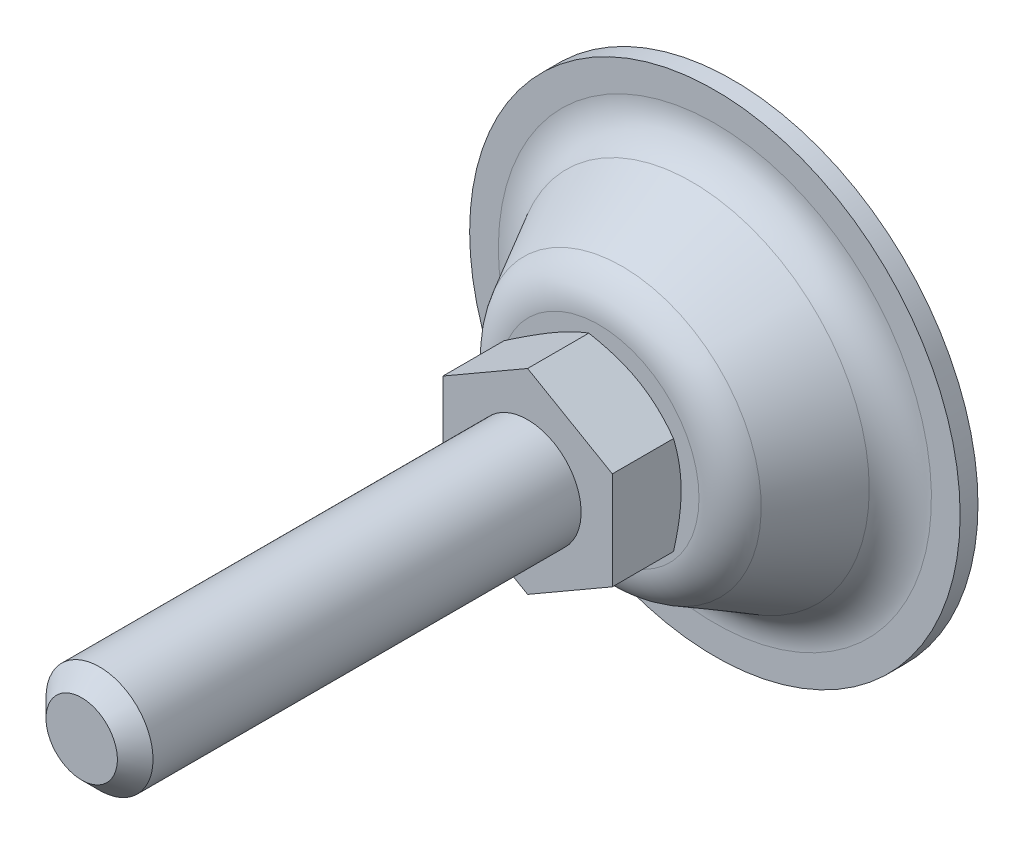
ISO-10303-21;
HEADER;
FILE_DESCRIPTION(('STEP AP214'),'2;1');
FILE_NAME('part.step','',(''),(''),'','','');
FILE_SCHEMA(('AUTOMOTIVE_DESIGN { 1 0 10303 214 1 1 1 1 }'));
ENDSEC;
DATA;
#1=APPLICATION_CONTEXT('core data for automotive mechanical design processes');
#2=APPLICATION_PROTOCOL_DEFINITION('international standard','automotive_design',2000,#1);
#3=PRODUCT_CONTEXT('',#1,'mechanical');
#4=PRODUCT('Part','Part','',(#3));
#5=PRODUCT_RELATED_PRODUCT_CATEGORY('part','',(#4));
#6=PRODUCT_DEFINITION_FORMATION('','',#4);
#7=PRODUCT_DEFINITION_CONTEXT('part definition',#1,'design');
#8=PRODUCT_DEFINITION('design','',#6,#7);
#9=PRODUCT_DEFINITION_SHAPE('','',#8);
#10=(LENGTH_UNIT() NAMED_UNIT(*) SI_UNIT(.MILLI.,.METRE.));
#11=(NAMED_UNIT(*) PLANE_ANGLE_UNIT() SI_UNIT($,.RADIAN.));
#12=(NAMED_UNIT(*) SI_UNIT($,.STERADIAN.) SOLID_ANGLE_UNIT());
#13=UNCERTAINTY_MEASURE_WITH_UNIT(LENGTH_MEASURE(1.E-05),#10,'distance_accuracy_value','');
#14=(GEOMETRIC_REPRESENTATION_CONTEXT(3) GLOBAL_UNCERTAINTY_ASSIGNED_CONTEXT((#13)) GLOBAL_UNIT_ASSIGNED_CONTEXT((#10,
#11,#12)) REPRESENTATION_CONTEXT('',''));
#15=CARTESIAN_POINT('',(0.,0.,0.));
#16=DIRECTION('',(0.,0.,1.));
#17=DIRECTION('',(1.,0.,0.));
#18=AXIS2_PLACEMENT_3D('',#15,#16,#17);
#19=CARTESIAN_POINT('',(0.,0.,23.));
#20=DIRECTION('',(0.,0.,1.));
#21=DIRECTION('',(0.5,-0.866025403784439,0.));
#22=AXIS2_PLACEMENT_3D('',#19,#20,#21);
#23=PLANE('',#22);
#24=DIRECTION('',(0.,1.,0.));
#25=VECTOR('',#24,1.);
#26=CARTESIAN_POINT('',(9.5,-5.48482755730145,23.));
#27=LINE('',#26,#25);
#28=CARTESIAN_POINT('',(9.5,-5.48482755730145,23.));
#29=VERTEX_POINT('',#28);
#30=CARTESIAN_POINT('',(9.5,5.48482755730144,23.));
#31=VERTEX_POINT('',#30);
#32=EDGE_CURVE('E218',#29,#31,#27,.T.);
#33=ORIENTED_EDGE('',*,*,#32,.T.);
#34=DIRECTION('',(-0.866025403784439,0.5,0.));
#35=VECTOR('',#34,1.);
#36=CARTESIAN_POINT('',(9.5,5.48482755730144,23.));
#37=LINE('',#36,#35);
#38=CARTESIAN_POINT('',(0.,10.9696551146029,23.));
#39=VERTEX_POINT('',#38);
#40=EDGE_CURVE('E359',#31,#39,#37,.T.);
#41=ORIENTED_EDGE('',*,*,#40,.T.);
#42=DIRECTION('',(-0.866025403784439,-0.5,0.));
#43=VECTOR('',#42,1.);
#44=CARTESIAN_POINT('',(0.,10.9696551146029,23.));
#45=LINE('',#44,#43);
#46=CARTESIAN_POINT('',(-9.5,5.48482755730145,23.));
#47=VERTEX_POINT('',#46);
#48=EDGE_CURVE('E358',#39,#47,#45,.T.);
#49=ORIENTED_EDGE('',*,*,#48,.T.);
#50=DIRECTION('',(0.,-1.,0.));
#51=VECTOR('',#50,1.);
#52=CARTESIAN_POINT('',(-9.5,5.48482755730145,23.));
#53=LINE('',#52,#51);
#54=CARTESIAN_POINT('',(-9.5,-5.48482755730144,23.));
#55=VERTEX_POINT('',#54);
#56=EDGE_CURVE('E363',#47,#55,#53,.T.);
#57=ORIENTED_EDGE('',*,*,#56,.T.);
#58=DIRECTION('',(0.866025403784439,-0.5,0.));
#59=VECTOR('',#58,1.);
#60=CARTESIAN_POINT('',(-9.5,-5.48482755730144,23.));
#61=LINE('',#60,#59);
#62=CARTESIAN_POINT('',(0.,-10.9696551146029,23.));
#63=VERTEX_POINT('',#62);
#64=EDGE_CURVE('E365',#55,#63,#61,.T.);
#65=ORIENTED_EDGE('',*,*,#64,.T.);
#66=DIRECTION('',(0.866025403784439,0.5,0.));
#67=VECTOR('',#66,1.);
#68=CARTESIAN_POINT('',(0.,-10.9696551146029,23.));
#69=LINE('',#68,#67);
#70=EDGE_CURVE('E37',#63,#29,#69,.T.);
#71=ORIENTED_EDGE('',*,*,#70,.T.);
#72=EDGE_LOOP('',(#33,#41,#49,#57,#65,#71));
#73=FACE_BOUND('',#72,.T.);
#74=CARTESIAN_POINT('',(0.,0.,23.));
#75=DIRECTION('',(0.,0.,1.));
#76=DIRECTION('',(0.5,-0.866025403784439,0.));
#77=AXIS2_PLACEMENT_3D('',#74,#75,#76);
#78=CIRCLE('',#77,6.);
#79=CARTESIAN_POINT('',(3.,-5.19615242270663,23.));
#80=VERTEX_POINT('',#79);
#81=EDGE_CURVE('E222',#80,#80,#78,.T.);
#82=ORIENTED_EDGE('',*,*,#81,.F.);
#83=EDGE_LOOP('',(#82));
#84=FACE_BOUND('',#83,.T.);
#85=ADVANCED_FACE('F14',(#73,#84),#23,.T.);
#86=CARTESIAN_POINT('',(0.,0.,15.));
#87=DIRECTION('',(0.,0.,1.));
#88=DIRECTION('',(0.5,-0.866025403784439,0.));
#89=AXIS2_PLACEMENT_3D('',#86,#87,#88);
#90=PLANE('',#89);
#91=CARTESIAN_POINT('',(0.,0.,15.));
#92=DIRECTION('',(0.,0.,-1.));
#93=DIRECTION('',(-0.5,0.866025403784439,0.));
#94=AXIS2_PLACEMENT_3D('',#91,#92,#93);
#95=CIRCLE('',#94,11.2198194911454);
#96=CARTESIAN_POINT('',(-5.60990974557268,9.71664870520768,15.));
#97=VERTEX_POINT('',#96);
#98=EDGE_CURVE('E102',#97,#97,#95,.T.);
#99=ORIENTED_EDGE('',*,*,#98,.F.);
#100=EDGE_LOOP('',(#99));
#101=FACE_BOUND('',#100,.T.);
#102=CARTESIAN_POINT('',(0.,0.,15.));
#103=DIRECTION('',(0.,0.,-1.));
#104=DIRECTION('',(-0.5,0.866025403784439,0.));
#105=AXIS2_PLACEMENT_3D('',#102,#103,#104);
#106=CIRCLE('',#105,9.);
#107=CARTESIAN_POINT('',(-4.5,7.79422863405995,15.));
#108=VERTEX_POINT('',#107);
#109=EDGE_CURVE('E84',#108,#108,#106,.T.);
#110=ORIENTED_EDGE('',*,*,#109,.T.);
#111=EDGE_LOOP('',(#110));
#112=FACE_BOUND('',#111,.T.);
#113=ADVANCED_FACE('F183',(#101,#112),#90,.T.);
#114=CARTESIAN_POINT('',(0.,0.,0.));
#115=DIRECTION('',(0.,0.,-1.));
#116=DIRECTION('',(-0.5,0.866025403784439,0.));
#117=AXIS2_PLACEMENT_3D('',#114,#115,#116);
#118=PLANE('',#117);
#119=CARTESIAN_POINT('',(0.,0.,0.));
#120=DIRECTION('',(0.,0.,-1.));
#121=DIRECTION('',(-0.5,0.866025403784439,0.));
#122=AXIS2_PLACEMENT_3D('',#119,#120,#121);
#123=CIRCLE('',#122,27.5);
#124=CARTESIAN_POINT('',(-13.75,23.8156986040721,0.));
#125=VERTEX_POINT('',#124);
#126=EDGE_CURVE('E73',#125,#125,#123,.T.);
#127=ORIENTED_EDGE('',*,*,#126,.T.);
#128=EDGE_LOOP('',(#127));
#129=FACE_BOUND('',#128,.T.);
#130=ADVANCED_FACE('F186',(#129),#118,.T.);
#131=CARTESIAN_POINT('',(0.,0.,-9.3525294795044));
#132=DIRECTION('',(0.,0.,-1.));
#133=DIRECTION('',(-0.5,0.866025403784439,0.));
#134=AXIS2_PLACEMENT_3D('',#131,#132,#133);
#135=CYLINDRICAL_SURFACE('',#134,27.5);
#136=CARTESIAN_POINT('',(0.,0.,2.));
#137=DIRECTION('',(0.,0.,-1.));
#138=DIRECTION('',(-0.5,0.866025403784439,0.));
#139=AXIS2_PLACEMENT_3D('',#136,#137,#138);
#140=CIRCLE('',#139,27.5);
#141=CARTESIAN_POINT('',(-13.75,23.8156986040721,2.));
#142=VERTEX_POINT('',#141);
#143=EDGE_CURVE('E114',#142,#142,#140,.T.);
#144=ORIENTED_EDGE('',*,*,#143,.T.);
#145=EDGE_LOOP('',(#144));
#146=FACE_BOUND('',#145,.T.);
#147=ORIENTED_EDGE('',*,*,#126,.F.);
#148=EDGE_LOOP('',(#147));
#149=FACE_BOUND('',#148,.T.);
#150=ADVANCED_FACE('F202',(#146,#149),#135,.T.);
#151=CARTESIAN_POINT('',(-13.75,23.8156986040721,2.));
#152=DIRECTION('',(0.,0.,1.));
#153=DIRECTION('',(0.5,-0.866025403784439,0.));
#154=AXIS2_PLACEMENT_3D('',#151,#152,#153);
#155=PLANE('',#154);
#156=CARTESIAN_POINT('',(0.,0.,2.));
#157=DIRECTION('',(0.,0.,-1.));
#158=DIRECTION('',(-0.5,0.866025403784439,0.));
#159=AXIS2_PLACEMENT_3D('',#156,#157,#158);
#160=CIRCLE('',#159,24.2801624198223);
#161=CARTESIAN_POINT('',(-12.1400812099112,21.0272374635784,2.));
#162=VERTEX_POINT('',#161);
#163=EDGE_CURVE('E111',#162,#162,#160,.T.);
#164=ORIENTED_EDGE('',*,*,#163,.T.);
#165=EDGE_LOOP('',(#164));
#166=FACE_BOUND('',#165,.T.);
#167=ORIENTED_EDGE('',*,*,#143,.F.);
#168=EDGE_LOOP('',(#167));
#169=FACE_BOUND('',#168,.T.);
#170=ADVANCED_FACE('F198',(#166,#169),#155,.T.);
#171=CARTESIAN_POINT('',(0.,0.,7.));
#172=DIRECTION('',(0.,0.,-1.));
#173=DIRECTION('',(-0.5,0.866025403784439,0.));
#174=AXIS2_PLACEMENT_3D('',#171,#172,#173);
#175=TOROIDAL_SURFACE('',#174,24.2801624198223,5.);
#176=CARTESIAN_POINT('',(0.,0.,4.59142577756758));
#177=DIRECTION('',(0.,0.,-1.));
#178=DIRECTION('',(-0.5,0.866025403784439,0.));
#179=AXIS2_PLACEMENT_3D('',#176,#177,#178);
#180=CIRCLE('',#179,19.8985222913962);
#181=CARTESIAN_POINT('',(-9.9492611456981,17.2326258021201,4.59142577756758));
#182=VERTEX_POINT('',#181);
#183=EDGE_CURVE('E108',#182,#182,#180,.T.);
#184=ORIENTED_EDGE('',*,*,#183,.T.);
#185=EDGE_LOOP('',(#184));
#186=FACE_BOUND('',#185,.T.);
#187=ORIENTED_EDGE('',*,*,#163,.F.);
#188=EDGE_LOOP('',(#187));
#189=FACE_BOUND('',#188,.T.);
#190=ADVANCED_FACE('F194',(#186,#189),#175,.F.);
#191=CARTESIAN_POINT('',(0.,0.,4.59142577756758));
#192=DIRECTION('',(0.,0.,-1.));
#193=DIRECTION('',(-0.5,0.866025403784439,0.));
#194=AXIS2_PLACEMENT_3D('',#191,#192,#193);
#195=CONICAL_SURFACE('',#194,19.8985222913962,0.50261051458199);
#196=CARTESIAN_POINT('',(0.,0.,12.4085742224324));
#197=DIRECTION('',(0.,0.,-1.));
#198=DIRECTION('',(-0.5,0.866025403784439,0.));
#199=AXIS2_PLACEMENT_3D('',#196,#197,#198);
#200=CIRCLE('',#199,15.6014596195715);
#201=CARTESIAN_POINT('',(-7.80072980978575,13.511260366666,12.4085742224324));
#202=VERTEX_POINT('',#201);
#203=EDGE_CURVE('E105',#202,#202,#200,.T.);
#204=ORIENTED_EDGE('',*,*,#203,.T.);
#205=EDGE_LOOP('',(#204));
#206=FACE_BOUND('',#205,.T.);
#207=ORIENTED_EDGE('',*,*,#183,.F.);
#208=EDGE_LOOP('',(#207));
#209=FACE_BOUND('',#208,.T.);
#210=ADVANCED_FACE('F190',(#206,#209),#195,.T.);
#211=CARTESIAN_POINT('',(0.,0.,10.));
#212=DIRECTION('',(0.,0.,-1.));
#213=DIRECTION('',(-0.5,0.866025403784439,0.));
#214=AXIS2_PLACEMENT_3D('',#211,#212,#213);
#215=TOROIDAL_SURFACE('',#214,11.2198194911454,5.);
#216=ORIENTED_EDGE('',*,*,#98,.T.);
#217=EDGE_LOOP('',(#216));
#218=FACE_BOUND('',#217,.T.);
#219=ORIENTED_EDGE('',*,*,#203,.F.);
#220=EDGE_LOOP('',(#219));
#221=FACE_BOUND('',#220,.T.);
#222=ADVANCED_FACE('F130',(#218,#221),#215,.T.);
#223=CARTESIAN_POINT('',(0.,0.,18.9793107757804));
#224=DIRECTION('',(0.,0.,1.));
#225=DIRECTION('',(0.5,-0.866025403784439,0.));
#226=AXIS2_PLACEMENT_3D('',#223,#224,#225);
#227=CONICAL_SURFACE('',#226,15.8923684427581,1.0471975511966);
#228=ORIENTED_EDGE('',*,*,#109,.F.);
#229=EDGE_LOOP('',(#228));
#230=FACE_BOUND('',#229,.T.);
#231=CARTESIAN_POINT('',(-8.15701159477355,-15.6791079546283,20.0079523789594));
#232=CARTESIAN_POINT('',(-7.97671168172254,-15.5750117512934,19.9065949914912));
#233=CARTESIAN_POINT('',(-7.79620414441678,-15.4707956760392,19.8057302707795));
#234=CARTESIAN_POINT('',(-7.43473055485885,-15.262098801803,19.6050974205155));
#235=CARTESIAN_POINT('',(-7.25376449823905,-15.1576180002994,19.5053293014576));
#236=CARTESIAN_POINT('',(-6.71006743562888,-14.8437143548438,19.2078115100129));
#237=CARTESIAN_POINT('',(-6.34658864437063,-14.6338597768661,19.0118772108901));
#238=CARTESIAN_POINT('',(-5.6153393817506,-14.2116728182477,18.6249838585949));
#239=CARTESIAN_POINT('',(-5.24755640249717,-13.9993332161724,18.4340562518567));
#240=CARTESIAN_POINT('',(-4.5091170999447,-13.5729950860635,18.059786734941));
#241=CARTESIAN_POINT('',(-4.13846090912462,-13.3589966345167,17.8764444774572));
#242=CARTESIAN_POINT('',(-3.38118032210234,-12.9217804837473,17.5133517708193));
#243=CARTESIAN_POINT('',(-2.99443761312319,-12.6984944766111,17.3339285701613));
#244=CARTESIAN_POINT('',(-2.21648353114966,-12.2493424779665,16.9882522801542));
#245=CARTESIAN_POINT('',(-1.82527167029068,-12.0234762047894,16.8220006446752));
#246=CARTESIAN_POINT('',(-1.03843766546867,-11.5691973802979,16.5069077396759));
#247=CARTESIAN_POINT('',(-0.642825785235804,-11.3407907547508,16.3580326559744));
#248=CARTESIAN_POINT('',(0.154057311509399,-10.8807100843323,16.0823550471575));
#249=CARTESIAN_POINT('',(0.555326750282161,-10.6490370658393,15.9555457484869));
#250=CARTESIAN_POINT('',(1.36156962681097,-10.1835525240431,15.730660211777));
#251=CARTESIAN_POINT('',(1.7665083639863,-9.94976103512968,15.6324225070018));
#252=CARTESIAN_POINT('',(2.37771950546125,-9.59687811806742,15.5106601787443));
#253=CARTESIAN_POINT('',(2.58210426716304,-9.47887652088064,15.4743368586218));
#254=CARTESIAN_POINT('',(2.99193920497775,-9.24225820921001,15.4109296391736));
#255=CARTESIAN_POINT('',(3.19738927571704,-9.12364155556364,15.3838448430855));
#256=CARTESIAN_POINT('',(3.60633071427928,-8.88753910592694,15.3398031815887));
#257=CARTESIAN_POINT('',(3.80981147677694,-8.77005943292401,15.3227155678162));
#258=CARTESIAN_POINT('',(4.21721696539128,-8.53484376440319,15.2984994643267));
#259=CARTESIAN_POINT('',(4.42114168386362,-8.41710777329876,15.2913708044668));
#260=CARTESIAN_POINT('',(4.82906985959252,-8.18159033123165,15.2872433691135));
#261=CARTESIAN_POINT('',(5.03307331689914,-8.06380888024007,15.2902446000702));
#262=CARTESIAN_POINT('',(5.44078563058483,-7.8284160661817,15.3063014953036));
#263=CARTESIAN_POINT('',(5.64449447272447,-7.71080471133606,15.3193576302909));
#264=CARTESIAN_POINT('',(6.12963344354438,-7.43070959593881,15.3621439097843));
#265=CARTESIAN_POINT('',(6.41077353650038,-7.26839328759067,15.3963598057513));
#266=CARTESIAN_POINT('',(6.97105016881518,-6.94491742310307,15.482114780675));
#267=CARTESIAN_POINT('',(7.25018644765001,-6.7837580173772,15.5336560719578));
#268=CARTESIAN_POINT('',(8.08422220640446,-6.30222724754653,15.7115431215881));
#269=CARTESIAN_POINT('',(8.63545892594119,-5.98397057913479,15.8611230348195));
#270=CARTESIAN_POINT('',(9.45994897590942,-5.50795102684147,16.1217474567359));
#271=CARTESIAN_POINT('',(9.73744916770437,-5.34773621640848,16.2159197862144));
#272=CARTESIAN_POINT('',(10.289756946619,-5.0288611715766,16.4143552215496));
#273=CARTESIAN_POINT('',(10.5645645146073,-4.87020094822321,16.5186183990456));
#274=CARTESIAN_POINT('',(11.1115689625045,-4.55438778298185,16.7355370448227));
#275=CARTESIAN_POINT('',(11.3837665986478,-4.39723440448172,16.8481899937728));
#276=CARTESIAN_POINT('',(11.9258880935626,-4.08424041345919,17.0805318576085));
#277=CARTESIAN_POINT('',(12.1958119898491,-3.92839977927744,17.2002206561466));
#278=CARTESIAN_POINT('',(12.8727098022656,-3.53759264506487,17.5088865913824));
#279=CARTESIAN_POINT('',(13.278374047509,-3.30338228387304,17.7016878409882));
#280=CARTESIAN_POINT('',(14.0858986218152,-2.83715775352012,18.0976682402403));
#281=CARTESIAN_POINT('',(14.4877586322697,-2.60514376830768,18.3008482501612));
#282=CARTESIAN_POINT('',(15.2884562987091,-2.14286075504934,18.7153364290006));
#283=CARTESIAN_POINT('',(15.6872930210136,-1.91259226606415,18.9266469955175));
#284=CARTESIAN_POINT('',(16.4823758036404,-1.45355100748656,19.3556165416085));
#285=CARTESIAN_POINT('',(16.8786219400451,-1.22477819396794,19.5732753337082));
#286=CARTESIAN_POINT('',(17.6695213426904,-0.768152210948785,20.0139591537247));
#287=CARTESIAN_POINT('',(18.0641717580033,-0.540300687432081,20.2369909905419));
#288=CARTESIAN_POINT('',(18.8517115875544,-0.0856143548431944,20.6871626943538));
#289=CARTESIAN_POINT('',(19.2446009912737,0.141220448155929,20.9143025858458));
#290=CARTESIAN_POINT('',(20.0288426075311,0.594002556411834,21.3718987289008));
#291=CARTESIAN_POINT('',(20.4201950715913,0.819950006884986,21.6023544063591));
#292=CARTESIAN_POINT('',(21.2016656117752,1.27113223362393,22.0660411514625));
#293=CARTESIAN_POINT('',(21.5917836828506,1.49636700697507,22.2992722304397));
#294=CARTESIAN_POINT('',(22.6873922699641,2.1289169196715,22.9583931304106));
#295=CARTESIAN_POINT('',(23.3916953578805,2.53554649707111,23.3869143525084));
#296=CARTESIAN_POINT('',(24.7977714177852,3.34734488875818,24.2495346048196));
#297=CARTESIAN_POINT('',(25.499544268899,3.75251363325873,24.6836338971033));
#298=CARTESIAN_POINT('',(26.8990618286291,4.56052547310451,25.5547677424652));
#299=CARTESIAN_POINT('',(27.5968123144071,4.96337190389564,25.991789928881));
#300=CARTESIAN_POINT('',(28.6422636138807,5.56696349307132,26.6497454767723));
#301=CARTESIAN_POINT('',(28.9905403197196,5.76804114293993,26.8694605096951));
#302=CARTESIAN_POINT('',(29.6867494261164,6.16999765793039,27.3096154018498));
#303=CARTESIAN_POINT('',(30.0346818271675,6.37087652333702,27.5300552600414));
#304=CARTESIAN_POINT('',(30.3824623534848,6.57166770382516,27.7508142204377));
#305=B_SPLINE_CURVE_WITH_KNOTS('',3,(#231,#232,#233,#234,#235,#236,#237,#238,#239,#240,#241,
#242,#243,#244,#245,#246,#247,#248,#249,#250,#251,#252,#253,#254,#255,#256,#257,#258,#259,#260,
#261,#262,#263,#264,#265,#266,#267,#268,#269,#270,#271,#272,#273,#274,#275,#276,#277,#278,#279,
#280,#281,#282,#283,#284,#285,#286,#287,#288,#289,#290,#291,#292,#293,#294,#295,#296,#297,#298,
#299,#300,#301,#302,#303,#304),.UNSPECIFIED.,.F.,.F.,(4,2,2,2,2,2,2,2,2,2,2,2,2,2,2,2,2,2,2,2,2,
2,2,2,2,2,2,2,2,2,2,2,2,2,2,2,4),(0.,0.694661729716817,1.3893301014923,2.77886384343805,
4.17567800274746,5.57242813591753,7.01607199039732,8.45987497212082,9.90081979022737,
11.3413214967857,12.7735168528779,13.4897108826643,14.2058353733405,14.9123716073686,
15.6188957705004,16.3254203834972,17.0319780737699,18.0107209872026,18.9895889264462,
20.9483275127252,21.9501834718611,22.9520465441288,23.9536099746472,24.9551568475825,
26.4746221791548,27.9942136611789,29.5142567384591,31.0342549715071,32.5562928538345,
34.0783398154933,35.6001263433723,37.1219190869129,39.8796363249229,42.6374836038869,
45.3872304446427,46.7620143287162,48.1367962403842),.UNSPECIFIED.);
#306=CARTESIAN_POINT('',(0.,-10.9696551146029,16.1371809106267));
#307=VERTEX_POINT('',#306);
#308=CARTESIAN_POINT('',(9.5,-5.48482755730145,16.1371809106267));
#309=VERTEX_POINT('',#308);
#310=EDGE_CURVE('E65',#307,#309,#305,.T.);
#311=ORIENTED_EDGE('',*,*,#310,.F.);
#312=CARTESIAN_POINT('',(-9.5002,-5.4847120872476,16.137247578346));
#313=CARTESIAN_POINT('',(-9.29136922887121,-5.60528058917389,16.0676485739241));
#314=CARTESIAN_POINT('',(-9.0817598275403,-5.72629863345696,16.001208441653));
#315=CARTESIAN_POINT('',(-8.66086011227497,-5.96930519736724,15.8755224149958));
#316=CARTESIAN_POINT('',(-8.44956926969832,-6.09129402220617,15.8162788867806));
#317=CARTESIAN_POINT('',(-7.81229220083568,-6.45922610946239,15.6504897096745));
#318=CARTESIAN_POINT('',(-7.38379023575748,-6.70662183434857,15.5561895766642));
#319=CARTESIAN_POINT('',(-6.74255666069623,-7.07683821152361,15.4456138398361));
#320=CARTESIAN_POINT('',(-6.53174078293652,-7.19855281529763,15.4141149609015));
#321=CARTESIAN_POINT('',(-6.10913296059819,-7.4425455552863,15.3612933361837));
#322=CARTESIAN_POINT('',(-5.89734099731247,-7.56482370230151,15.3399707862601));
#323=CARTESIAN_POINT('',(-5.47340378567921,-7.80958396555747,15.3080481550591));
#324=CARTESIAN_POINT('',(-5.26125925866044,-7.93206566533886,15.2974353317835));
#325=CARTESIAN_POINT('',(-4.83677424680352,-8.17714220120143,15.2871576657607));
#326=CARTESIAN_POINT('',(-4.62443376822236,-8.29973703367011,15.2874924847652));
#327=CARTESIAN_POINT('',(-4.22745800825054,-8.5289310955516,15.2983485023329));
#328=CARTESIAN_POINT('',(-4.04279470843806,-8.63554650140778,15.307545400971));
#329=CARTESIAN_POINT('',(-3.67389999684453,-8.84852796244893,15.3340405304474));
#330=CARTESIAN_POINT('',(-3.48966861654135,-8.95489399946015,15.3513393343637));
#331=CARTESIAN_POINT('',(-2.93768832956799,-9.27357996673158,15.4149796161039));
#332=CARTESIAN_POINT('',(-2.57091646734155,-9.48533580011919,15.4730570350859));
#333=CARTESIAN_POINT('',(-1.83348217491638,-9.91109368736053,15.618251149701));
#334=CARTESIAN_POINT('',(-1.46291385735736,-10.1250414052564,15.7059833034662));
#335=CARTESIAN_POINT('',(-0.727303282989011,-10.5497463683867,15.9050988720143));
#336=CARTESIAN_POINT('',(-0.362251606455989,-10.7605090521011,16.0164355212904));
#337=CARTESIAN_POINT('',(0.000200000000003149,-10.9697705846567,16.137247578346));
#338=B_SPLINE_CURVE_WITH_KNOTS('',3,(#312,#313,#314,#315,#316,#317,#318,#319,#320,#321,#322,
#323,#324,#325,#326,#327,#328,#329,#330,#331,#332,#333,#334,#335,#336,#337),.UNSPECIFIED.,.F.,
.F.,(4,2,2,2,2,2,2,2,2,2,2,2,4),(0.,0.752880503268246,1.50600787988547,3.01546870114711,
3.75167336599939,4.48789219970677,5.22323407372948,5.95855322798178,6.59868084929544,
7.238853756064,8.5201092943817,9.82978009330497,11.1368800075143),.UNSPECIFIED.);
#339=CARTESIAN_POINT('',(-9.5,-5.48482755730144,16.1371809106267));
#340=VERTEX_POINT('',#339);
#341=EDGE_CURVE('E68',#340,#307,#338,.T.);
#342=ORIENTED_EDGE('',*,*,#341,.F.);
#343=CARTESIAN_POINT('',(-9.5,5.48505849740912,16.137247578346));
#344=CARTESIAN_POINT('',(-9.5,5.24392149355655,16.0676485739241));
#345=CARTESIAN_POINT('',(-9.5,5.0018854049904,16.001208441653));
#346=CARTESIAN_POINT('',(-9.5,4.51587227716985,15.8755224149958));
#347=CARTESIAN_POINT('',(-9.5,4.27189462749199,15.8162788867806));
#348=CARTESIAN_POINT('',(-9.5,3.53603045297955,15.6504897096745));
#349=CARTESIAN_POINT('',(-9.5,3.04123900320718,15.5561895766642));
#350=CARTESIAN_POINT('',(-9.5,2.30080624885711,15.4456138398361));
#351=CARTESIAN_POINT('',(-9.5,2.05737704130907,15.4141149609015));
#352=CARTESIAN_POINT('',(-9.5,1.56939156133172,15.3612933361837));
#353=CARTESIAN_POINT('',(-9.5,1.3248352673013,15.3399707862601));
#354=CARTESIAN_POINT('',(-9.5,0.835314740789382,15.3080481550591));
#355=CARTESIAN_POINT('',(-9.5,0.590351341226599,15.2974353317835));
#356=CARTESIAN_POINT('',(-9.5,0.100198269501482,15.2871576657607));
#357=CARTESIAN_POINT('',(-9.5,-0.144991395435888,15.2874924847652));
#358=CARTESIAN_POINT('',(-9.5,-0.603379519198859,15.2983485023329));
#359=CARTESIAN_POINT('',(-9.5,-0.816610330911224,15.307545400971));
#360=CARTESIAN_POINT('',(-9.5,-1.24257325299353,15.3340405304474));
#361=CARTESIAN_POINT('',(-9.5,-1.45530532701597,15.3513393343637));
#362=CARTESIAN_POINT('',(-9.5,-2.09267726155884,15.4149796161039));
#363=CARTESIAN_POINT('',(-9.5,-2.51618892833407,15.4730570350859));
#364=CARTESIAN_POINT('',(-9.5,-3.36770470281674,15.618251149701));
#365=CARTESIAN_POINT('',(-9.5,-3.79560013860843,15.7059833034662));
#366=CARTESIAN_POINT('',(-9.5,-4.64501006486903,15.9050988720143));
#367=CARTESIAN_POINT('',(-9.5,-5.06653543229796,16.0164355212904));
#368=CARTESIAN_POINT('',(-9.5,-5.48505849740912,16.137247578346));
#369=B_SPLINE_CURVE_WITH_KNOTS('',3,(#343,#344,#345,#346,#347,#348,#349,#350,#351,#352,#353,
#354,#355,#356,#357,#358,#359,#360,#361,#362,#363,#364,#365,#366,#367,#368),.UNSPECIFIED.,.F.,
.F.,(4,2,2,2,2,2,2,2,2,2,2,2,4),(0.,0.752880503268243,1.50600787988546,3.01546870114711,
3.75167336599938,4.48789219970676,5.22323407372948,5.95855322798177,6.59868084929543,
7.23885375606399,8.5201092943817,9.82978009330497,11.1368800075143),.UNSPECIFIED.);
#370=CARTESIAN_POINT('',(-9.5,5.48482755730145,16.1371809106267));
#371=VERTEX_POINT('',#370);
#372=EDGE_CURVE('E83',#371,#340,#369,.T.);
#373=ORIENTED_EDGE('',*,*,#372,.F.);
#374=CARTESIAN_POINT('',(-17.6570115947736,0.775374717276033,20.0079523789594));
#375=CARTESIAN_POINT('',(-17.4767116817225,0.87947092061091,19.9065949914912));
#376=CARTESIAN_POINT('',(-17.2962041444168,0.98368699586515,19.8057302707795));
#377=CARTESIAN_POINT('',(-16.9347305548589,1.19238387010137,19.6050974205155));
#378=CARTESIAN_POINT('',(-16.7537644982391,1.29686467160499,19.5053293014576));
#379=CARTESIAN_POINT('',(-16.2100674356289,1.61076831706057,19.2078115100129));
#380=CARTESIAN_POINT('',(-15.8465886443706,1.82062289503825,19.0118772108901));
#381=CARTESIAN_POINT('',(-15.1153393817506,2.24280985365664,18.6249838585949));
#382=CARTESIAN_POINT('',(-14.7475564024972,2.45514945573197,18.4340562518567));
#383=CARTESIAN_POINT('',(-14.0091170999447,2.88148758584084,18.059786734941));
#384=CARTESIAN_POINT('',(-13.6384609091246,3.09548603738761,17.8764444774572));
#385=CARTESIAN_POINT('',(-12.8811803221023,3.532702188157,17.5133517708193));
#386=CARTESIAN_POINT('',(-12.4944376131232,3.75598819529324,17.3339285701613));
#387=CARTESIAN_POINT('',(-11.7164835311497,4.20514019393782,16.9882522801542));
#388=CARTESIAN_POINT('',(-11.3252716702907,4.43100646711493,16.8220006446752));
#389=CARTESIAN_POINT('',(-10.5384376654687,4.88528529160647,16.5069077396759));
#390=CARTESIAN_POINT('',(-10.1428257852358,5.11369191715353,16.3580326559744));
#391=CARTESIAN_POINT('',(-9.3459426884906,5.57377258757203,16.0823550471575));
#392=CARTESIAN_POINT('',(-8.94467324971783,5.80544560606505,15.9555457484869));
#393=CARTESIAN_POINT('',(-8.13843037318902,6.27093014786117,15.730660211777));
#394=CARTESIAN_POINT('',(-7.73349163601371,6.50472163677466,15.6324225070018));
#395=CARTESIAN_POINT('',(-7.12228049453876,6.85760455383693,15.5106601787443));
#396=CARTESIAN_POINT('',(-6.91789573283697,6.97560615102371,15.4743368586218));
#397=CARTESIAN_POINT('',(-6.50806079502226,7.21222446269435,15.4109296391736));
#398=CARTESIAN_POINT('',(-6.30261072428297,7.33084111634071,15.3838448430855));
#399=CARTESIAN_POINT('',(-5.89366928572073,7.56694356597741,15.3398031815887));
#400=CARTESIAN_POINT('',(-5.69018852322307,7.68442323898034,15.3227155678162));
#401=CARTESIAN_POINT('',(-5.28278303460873,7.91963890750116,15.2984994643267));
#402=CARTESIAN_POINT('',(-5.07885831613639,8.03737489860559,15.2913708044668));
#403=CARTESIAN_POINT('',(-4.67093014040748,8.2728923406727,15.2872433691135));
#404=CARTESIAN_POINT('',(-4.46692668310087,8.39067379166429,15.2902446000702));
#405=CARTESIAN_POINT('',(-4.05921436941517,8.62606660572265,15.3063014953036));
#406=CARTESIAN_POINT('',(-3.85550552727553,8.74367796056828,15.3193576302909));
#407=CARTESIAN_POINT('',(-3.37036655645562,9.02377307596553,15.3621439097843));
#408=CARTESIAN_POINT('',(-3.08922646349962,9.18608938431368,15.3963598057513));
#409=CARTESIAN_POINT('',(-2.52894983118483,9.50956524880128,15.482114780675));
#410=CARTESIAN_POINT('',(-2.24981355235,9.67072465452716,15.5336560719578));
#411=CARTESIAN_POINT('',(-1.41577779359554,10.1522554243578,15.7115431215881));
#412=CARTESIAN_POINT('',(-0.864541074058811,10.4705120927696,15.8611230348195));
#413=CARTESIAN_POINT('',(-0.0400510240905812,10.9465316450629,16.1217474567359));
#414=CARTESIAN_POINT('',(0.237449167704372,11.1067464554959,16.2159197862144));
#415=CARTESIAN_POINT('',(0.789756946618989,11.4256215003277,16.4143552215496));
#416=CARTESIAN_POINT('',(1.06456451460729,11.5842817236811,16.5186183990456));
#417=CARTESIAN_POINT('',(1.61156896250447,11.9000948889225,16.7355370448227));
#418=CARTESIAN_POINT('',(1.88376659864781,12.0572482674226,16.8481899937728));
#419=CARTESIAN_POINT('',(2.42588809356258,12.3702422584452,17.0805318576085));
#420=CARTESIAN_POINT('',(2.69581198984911,12.5260828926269,17.2002206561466));
#421=CARTESIAN_POINT('',(3.37270980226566,12.9168900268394,17.5088865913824));
#422=CARTESIAN_POINT('',(3.77837404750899,13.1511003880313,17.7016878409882));
#423=CARTESIAN_POINT('',(4.5858986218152,13.6173249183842,18.0976682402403));
#424=CARTESIAN_POINT('',(4.98775863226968,13.8493389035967,18.3008482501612));
#425=CARTESIAN_POINT('',(5.78845629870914,14.311621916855,18.7153364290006));
#426=CARTESIAN_POINT('',(6.18729302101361,14.5418904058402,18.9266469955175));
#427=CARTESIAN_POINT('',(6.98237580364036,15.0009316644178,19.3556165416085));
#428=CARTESIAN_POINT('',(7.37862194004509,15.2297044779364,19.5732753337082));
#429=CARTESIAN_POINT('',(8.16952134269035,15.6863304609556,20.0139591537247));
#430=CARTESIAN_POINT('',(8.56417175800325,15.9141819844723,20.2369909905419));
#431=CARTESIAN_POINT('',(9.35171158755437,16.3688683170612,20.6871626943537));
#432=CARTESIAN_POINT('',(9.74460099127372,16.5957031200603,20.9143025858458));
#433=CARTESIAN_POINT('',(10.5288426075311,17.0484852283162,21.3718987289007));
#434=CARTESIAN_POINT('',(10.9201950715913,17.2744326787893,21.6023544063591));
#435=CARTESIAN_POINT('',(11.7016656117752,17.7256149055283,22.0660411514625));
#436=CARTESIAN_POINT('',(12.0917836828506,17.9508496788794,22.2992722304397));
#437=CARTESIAN_POINT('',(13.1873922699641,18.5833995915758,22.9583931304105));
#438=CARTESIAN_POINT('',(13.8916953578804,18.9900291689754,23.3869143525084));
#439=CARTESIAN_POINT('',(15.2977714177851,19.8018275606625,24.2495346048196));
#440=CARTESIAN_POINT('',(15.999544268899,20.2069963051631,24.6836338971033));
#441=CARTESIAN_POINT('',(17.3990618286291,21.0150081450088,25.5547677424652));
#442=CARTESIAN_POINT('',(18.0968123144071,21.4178545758,25.991789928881));
#443=CARTESIAN_POINT('',(19.1422636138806,22.0214461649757,26.6497454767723));
#444=CARTESIAN_POINT('',(19.4905403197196,22.2225238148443,26.869460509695));
#445=CARTESIAN_POINT('',(20.1867494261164,22.6244803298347,27.3096154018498));
#446=CARTESIAN_POINT('',(20.5346818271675,22.8253591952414,27.5300552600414));
#447=CARTESIAN_POINT('',(20.8824623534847,23.0261503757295,27.7508142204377));
#448=B_SPLINE_CURVE_WITH_KNOTS('',3,(#374,#375,#376,#377,#378,#379,#380,#381,#382,#383,#384,
#385,#386,#387,#388,#389,#390,#391,#392,#393,#394,#395,#396,#397,#398,#399,#400,#401,#402,#403,
#404,#405,#406,#407,#408,#409,#410,#411,#412,#413,#414,#415,#416,#417,#418,#419,#420,#421,#422,
#423,#424,#425,#426,#427,#428,#429,#430,#431,#432,#433,#434,#435,#436,#437,#438,#439,#440,#441,
#442,#443,#444,#445,#446,#447),.UNSPECIFIED.,.F.,.F.,(4,2,2,2,2,2,2,2,2,2,2,2,2,2,2,2,2,2,2,2,2,
2,2,2,2,2,2,2,2,2,2,2,2,2,2,2,4),(0.,0.694661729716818,1.38933010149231,2.77886384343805,
4.17567800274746,5.57242813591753,7.01607199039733,8.45987497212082,9.90081979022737,
11.3413214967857,12.7735168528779,13.4897108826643,14.2058353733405,14.9123716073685,
15.6188957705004,16.3254203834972,17.0319780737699,18.0107209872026,18.9895889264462,
20.9483275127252,21.9501834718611,22.9520465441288,23.9536099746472,24.9551568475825,
26.4746221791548,27.9942136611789,29.5142567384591,31.0342549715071,32.5562928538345,
34.0783398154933,35.6001263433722,37.1219190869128,39.8796363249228,42.6374836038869,
45.3872304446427,46.7620143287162,48.1367962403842),.UNSPECIFIED.);
#449=CARTESIAN_POINT('',(0.,10.9696551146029,16.1371809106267));
#450=VERTEX_POINT('',#449);
#451=EDGE_CURVE('E152',#450,#371,#448,.F.);
#452=ORIENTED_EDGE('',*,*,#451,.F.);
#453=CARTESIAN_POINT('',(9.5002,5.4847120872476,16.137247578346));
#454=CARTESIAN_POINT('',(9.29136922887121,5.60528058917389,16.0676485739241));
#455=CARTESIAN_POINT('',(9.0817598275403,5.72629863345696,16.001208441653));
#456=CARTESIAN_POINT('',(8.66086011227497,5.96930519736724,15.8755224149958));
#457=CARTESIAN_POINT('',(8.44956926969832,6.09129402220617,15.8162788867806));
#458=CARTESIAN_POINT('',(7.81229220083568,6.45922610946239,15.6504897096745));
#459=CARTESIAN_POINT('',(7.38379023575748,6.70662183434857,15.5561895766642));
#460=CARTESIAN_POINT('',(6.74255666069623,7.07683821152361,15.4456138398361));
#461=CARTESIAN_POINT('',(6.53174078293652,7.19855281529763,15.4141149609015));
#462=CARTESIAN_POINT('',(6.10913296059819,7.4425455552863,15.3612933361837));
#463=CARTESIAN_POINT('',(5.89734099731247,7.56482370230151,15.3399707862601));
#464=CARTESIAN_POINT('',(5.47340378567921,7.80958396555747,15.3080481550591));
#465=CARTESIAN_POINT('',(5.26125925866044,7.93206566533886,15.2974353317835));
#466=CARTESIAN_POINT('',(4.83677424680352,8.17714220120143,15.2871576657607));
#467=CARTESIAN_POINT('',(4.62443376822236,8.29973703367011,15.2874924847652));
#468=CARTESIAN_POINT('',(4.22745800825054,8.5289310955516,15.2983485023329));
#469=CARTESIAN_POINT('',(4.04279470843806,8.63554650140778,15.307545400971));
#470=CARTESIAN_POINT('',(3.67389999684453,8.84852796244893,15.3340405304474));
#471=CARTESIAN_POINT('',(3.48966861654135,8.95489399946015,15.3513393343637));
#472=CARTESIAN_POINT('',(2.93768832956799,9.27357996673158,15.4149796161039));
#473=CARTESIAN_POINT('',(2.57091646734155,9.48533580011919,15.4730570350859));
#474=CARTESIAN_POINT('',(1.83348217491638,9.91109368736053,15.618251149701));
#475=CARTESIAN_POINT('',(1.46291385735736,10.1250414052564,15.7059833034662));
#476=CARTESIAN_POINT('',(0.727303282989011,10.5497463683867,15.9050988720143));
#477=CARTESIAN_POINT('',(0.362251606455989,10.7605090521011,16.0164355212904));
#478=CARTESIAN_POINT('',(-0.000200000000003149,10.9697705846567,16.137247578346));
#479=B_SPLINE_CURVE_WITH_KNOTS('',3,(#453,#454,#455,#456,#457,#458,#459,#460,#461,#462,#463,
#464,#465,#466,#467,#468,#469,#470,#471,#472,#473,#474,#475,#476,#477,#478),.UNSPECIFIED.,.F.,
.F.,(4,2,2,2,2,2,2,2,2,2,2,2,4),(0.,0.752880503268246,1.50600787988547,3.01546870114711,
3.75167336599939,4.48789219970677,5.22323407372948,5.95855322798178,6.59868084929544,
7.238853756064,8.5201092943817,9.82978009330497,11.1368800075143),.UNSPECIFIED.);
#480=CARTESIAN_POINT('',(9.5,5.48482755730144,16.1371809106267));
#481=VERTEX_POINT('',#480);
#482=EDGE_CURVE('E159',#481,#450,#479,.T.);
#483=ORIENTED_EDGE('',*,*,#482,.F.);
#484=CARTESIAN_POINT('',(9.5,-5.48505849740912,16.137247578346));
#485=CARTESIAN_POINT('',(9.5,-5.24392149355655,16.0676485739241));
#486=CARTESIAN_POINT('',(9.5,-5.0018854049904,16.001208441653));
#487=CARTESIAN_POINT('',(9.5,-4.51587227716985,15.8755224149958));
#488=CARTESIAN_POINT('',(9.5,-4.27189462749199,15.8162788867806));
#489=CARTESIAN_POINT('',(9.5,-3.53603045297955,15.6504897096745));
#490=CARTESIAN_POINT('',(9.5,-3.04123900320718,15.5561895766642));
#491=CARTESIAN_POINT('',(9.5,-2.3008062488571,15.4456138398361));
#492=CARTESIAN_POINT('',(9.5,-2.05737704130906,15.4141149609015));
#493=CARTESIAN_POINT('',(9.5,-1.56939156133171,15.3612933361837));
#494=CARTESIAN_POINT('',(9.5,-1.32483526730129,15.3399707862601));
#495=CARTESIAN_POINT('',(9.5,-0.835314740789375,15.3080481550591));
#496=CARTESIAN_POINT('',(9.5,-0.590351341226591,15.2974353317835));
#497=CARTESIAN_POINT('',(9.5,-0.100198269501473,15.2871576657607));
#498=CARTESIAN_POINT('',(9.5,0.144991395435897,15.2874924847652));
#499=CARTESIAN_POINT('',(9.5,0.603379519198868,15.2983485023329));
#500=CARTESIAN_POINT('',(9.5,0.816610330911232,15.307545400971));
#501=CARTESIAN_POINT('',(9.5,1.24257325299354,15.3340405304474));
#502=CARTESIAN_POINT('',(9.5,1.45530532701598,15.3513393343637));
#503=CARTESIAN_POINT('',(9.5,2.09267726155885,15.4149796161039));
#504=CARTESIAN_POINT('',(9.5,2.51618892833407,15.4730570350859));
#505=CARTESIAN_POINT('',(9.5,3.36770470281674,15.618251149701));
#506=CARTESIAN_POINT('',(9.5,3.79560013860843,15.7059833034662));
#507=CARTESIAN_POINT('',(9.5,4.64501006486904,15.9050988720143));
#508=CARTESIAN_POINT('',(9.5,5.06653543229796,16.0164355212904));
#509=CARTESIAN_POINT('',(9.5,5.48505849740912,16.137247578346));
#510=B_SPLINE_CURVE_WITH_KNOTS('',3,(#484,#485,#486,#487,#488,#489,#490,#491,#492,#493,#494,
#495,#496,#497,#498,#499,#500,#501,#502,#503,#504,#505,#506,#507,#508,#509),.UNSPECIFIED.,.F.,
.F.,(4,2,2,2,2,2,2,2,2,2,2,2,4),(0.,0.752880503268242,1.50600787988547,3.01546870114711,
3.75167336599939,4.48789219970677,5.22323407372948,5.95855322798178,6.59868084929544,
7.238853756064,8.5201092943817,9.82978009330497,11.1368800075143),.UNSPECIFIED.);
#511=EDGE_CURVE('E29',#309,#481,#510,.T.);
#512=ORIENTED_EDGE('',*,*,#511,.F.);
#513=EDGE_LOOP('',(#311,#342,#373,#452,#483,#512));
#514=FACE_BOUND('',#513,.T.);
#515=ADVANCED_FACE('F67',(#230,#514),#227,.T.);
#516=CARTESIAN_POINT('',(0.,-10.9696551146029,23.));
#517=DIRECTION('',(-0.5,0.866025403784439,0.));
#518=DIRECTION('',(0.,0.,1.));
#519=AXIS2_PLACEMENT_3D('',#516,#517,#518);
#520=PLANE('',#519);
#521=DIRECTION('',(0.,0.,-1.));
#522=VECTOR('',#521,1.);
#523=CARTESIAN_POINT('',(0.,-10.9696551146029,23.));
#524=LINE('',#523,#522);
#525=EDGE_CURVE('E80',#63,#307,#524,.T.);
#526=ORIENTED_EDGE('',*,*,#525,.T.);
#527=ORIENTED_EDGE('',*,*,#310,.T.);
#528=DIRECTION('',(0.,0.,-1.));
#529=VECTOR('',#528,1.);
#530=CARTESIAN_POINT('',(9.5,-5.48482755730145,23.));
#531=LINE('',#530,#529);
#532=EDGE_CURVE('E87',#29,#309,#531,.T.);
#533=ORIENTED_EDGE('',*,*,#532,.F.);
#534=ORIENTED_EDGE('',*,*,#70,.F.);
#535=EDGE_LOOP('',(#526,#527,#533,#534));
#536=FACE_BOUND('',#535,.T.);
#537=ADVANCED_FACE('F86',(#536),#520,.F.);
#538=CARTESIAN_POINT('',(-9.5,-5.48482755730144,23.));
#539=DIRECTION('',(0.5,0.866025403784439,0.));
#540=DIRECTION('',(-0.866025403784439,0.5,0.));
#541=AXIS2_PLACEMENT_3D('',#538,#539,#540);
#542=PLANE('',#541);
#543=DIRECTION('',(0.,0.,-1.));
#544=VECTOR('',#543,1.);
#545=CARTESIAN_POINT('',(-9.5,-5.48482755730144,23.));
#546=LINE('',#545,#544);
#547=EDGE_CURVE('E82',#55,#340,#546,.T.);
#548=ORIENTED_EDGE('',*,*,#547,.T.);
#549=ORIENTED_EDGE('',*,*,#341,.T.);
#550=ORIENTED_EDGE('',*,*,#525,.F.);
#551=ORIENTED_EDGE('',*,*,#64,.F.);
#552=EDGE_LOOP('',(#548,#549,#550,#551));
#553=FACE_BOUND('',#552,.T.);
#554=ADVANCED_FACE('F78',(#553),#542,.F.);
#555=CARTESIAN_POINT('',(-9.5,5.48482755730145,23.));
#556=DIRECTION('',(1.,0.,0.));
#557=DIRECTION('',(0.,1.,0.));
#558=AXIS2_PLACEMENT_3D('',#555,#556,#557);
#559=PLANE('',#558);
#560=DIRECTION('',(0.,0.,-1.));
#561=VECTOR('',#560,1.);
#562=CARTESIAN_POINT('',(-9.5,5.48482755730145,23.));
#563=LINE('',#562,#561);
#564=EDGE_CURVE('E89',#47,#371,#563,.T.);
#565=ORIENTED_EDGE('',*,*,#564,.T.);
#566=ORIENTED_EDGE('',*,*,#372,.T.);
#567=ORIENTED_EDGE('',*,*,#547,.F.);
#568=ORIENTED_EDGE('',*,*,#56,.F.);
#569=EDGE_LOOP('',(#565,#566,#567,#568));
#570=FACE_BOUND('',#569,.T.);
#571=ADVANCED_FACE('F336',(#570),#559,.F.);
#572=CARTESIAN_POINT('',(0.,10.9696551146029,23.));
#573=DIRECTION('',(0.5,-0.866025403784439,0.));
#574=DIRECTION('',(0.,0.,-1.));
#575=AXIS2_PLACEMENT_3D('',#572,#573,#574);
#576=PLANE('',#575);
#577=DIRECTION('',(0.,0.,-1.));
#578=VECTOR('',#577,1.);
#579=CARTESIAN_POINT('',(0.,10.9696551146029,23.));
#580=LINE('',#579,#578);
#581=EDGE_CURVE('E96',#39,#450,#580,.T.);
#582=ORIENTED_EDGE('',*,*,#581,.T.);
#583=ORIENTED_EDGE('',*,*,#451,.T.);
#584=ORIENTED_EDGE('',*,*,#564,.F.);
#585=ORIENTED_EDGE('',*,*,#48,.F.);
#586=EDGE_LOOP('',(#582,#583,#584,#585));
#587=FACE_BOUND('',#586,.T.);
#588=ADVANCED_FACE('F176',(#587),#576,.F.);
#589=CARTESIAN_POINT('',(9.5,5.48482755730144,23.));
#590=DIRECTION('',(-0.5,-0.866025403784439,0.));
#591=DIRECTION('',(0.866025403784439,-0.5,0.));
#592=AXIS2_PLACEMENT_3D('',#589,#590,#591);
#593=PLANE('',#592);
#594=DIRECTION('',(0.,0.,-1.));
#595=VECTOR('',#594,1.);
#596=CARTESIAN_POINT('',(9.5,5.48482755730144,23.));
#597=LINE('',#596,#595);
#598=EDGE_CURVE('E99',#31,#481,#597,.T.);
#599=ORIENTED_EDGE('',*,*,#598,.T.);
#600=ORIENTED_EDGE('',*,*,#482,.T.);
#601=ORIENTED_EDGE('',*,*,#581,.F.);
#602=ORIENTED_EDGE('',*,*,#40,.F.);
#603=EDGE_LOOP('',(#599,#600,#601,#602));
#604=FACE_BOUND('',#603,.T.);
#605=ADVANCED_FACE('F172',(#604),#593,.F.);
#606=CARTESIAN_POINT('',(9.5,-5.48482755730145,23.));
#607=DIRECTION('',(-1.,0.,0.));
#608=DIRECTION('',(0.,-1.,0.));
#609=AXIS2_PLACEMENT_3D('',#606,#607,#608);
#610=PLANE('',#609);
#611=ORIENTED_EDGE('',*,*,#532,.T.);
#612=ORIENTED_EDGE('',*,*,#511,.T.);
#613=ORIENTED_EDGE('',*,*,#598,.F.);
#614=ORIENTED_EDGE('',*,*,#32,.F.);
#615=EDGE_LOOP('',(#611,#612,#613,#614));
#616=FACE_BOUND('',#615,.T.);
#617=ADVANCED_FACE('F175',(#616),#610,.F.);
#618=CARTESIAN_POINT('',(0.,0.,73.));
#619=DIRECTION('',(0.,0.,-1.));
#620=DIRECTION('',(-0.5,0.866025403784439,0.));
#621=AXIS2_PLACEMENT_3D('',#618,#619,#620);
#622=CYLINDRICAL_SURFACE('',#621,6.);
#623=CARTESIAN_POINT('',(0.,0.,71.));
#624=DIRECTION('',(0.,0.,1.));
#625=DIRECTION('',(0.5,-0.866025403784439,0.));
#626=AXIS2_PLACEMENT_3D('',#623,#624,#625);
#627=CIRCLE('',#626,6.);
#628=CARTESIAN_POINT('',(3.,-5.19615242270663,71.));
#629=VERTEX_POINT('',#628);
#630=EDGE_CURVE('E9',#629,#629,#627,.F.);
#631=ORIENTED_EDGE('',*,*,#630,.T.);
#632=EDGE_LOOP('',(#631));
#633=FACE_BOUND('',#632,.T.);
#634=ORIENTED_EDGE('',*,*,#81,.T.);
#635=EDGE_LOOP('',(#634));
#636=FACE_BOUND('',#635,.T.);
#637=ADVANCED_FACE('F132',(#633,#636),#622,.T.);
#638=CARTESIAN_POINT('',(0.,0.,73.));
#639=DIRECTION('',(0.,0.,1.));
#640=DIRECTION('',(0.5,-0.866025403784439,0.));
#641=AXIS2_PLACEMENT_3D('',#638,#639,#640);
#642=PLANE('',#641);
#643=CARTESIAN_POINT('',(0.,0.,73.));
#644=DIRECTION('',(0.,0.,1.));
#645=DIRECTION('',(0.5,-0.866025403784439,0.));
#646=AXIS2_PLACEMENT_3D('',#643,#644,#645);
#647=CIRCLE('',#646,4.);
#648=CARTESIAN_POINT('',(2.,-3.46410161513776,73.));
#649=VERTEX_POINT('',#648);
#650=EDGE_CURVE('E22',#649,#649,#647,.T.);
#651=ORIENTED_EDGE('',*,*,#650,.T.);
#652=EDGE_LOOP('',(#651));
#653=FACE_BOUND('',#652,.T.);
#654=ADVANCED_FACE('F229',(#653),#642,.T.);
#655=CARTESIAN_POINT('',(0.,0.,73.));
#656=DIRECTION('',(0.,0.,-1.));
#657=DIRECTION('',(-0.5,0.866025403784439,0.));
#658=AXIS2_PLACEMENT_3D('',#655,#656,#657);
#659=CONICAL_SURFACE('',#658,4.,0.785398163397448);
#660=ORIENTED_EDGE('',*,*,#630,.F.);
#661=EDGE_LOOP('',(#660));
#662=FACE_BOUND('',#661,.T.);
#663=ORIENTED_EDGE('',*,*,#650,.F.);
#664=EDGE_LOOP('',(#663));
#665=FACE_BOUND('',#664,.T.);
#666=ADVANCED_FACE('F16',(#662,#665),#659,.T.);
#667=CLOSED_SHELL('',(#85,#113,#130,#150,#170,#190,#210,#222,#515,#537,#554,#571,#588,#605,#617,
#637,#654,#666));
#668=MANIFOLD_SOLID_BREP('B1',#667);
#669=ADVANCED_BREP_SHAPE_REPRESENTATION('',(#18,#668),#14);
#670=SHAPE_DEFINITION_REPRESENTATION(#9,#669);
ENDSEC;
END-ISO-10303-21;
